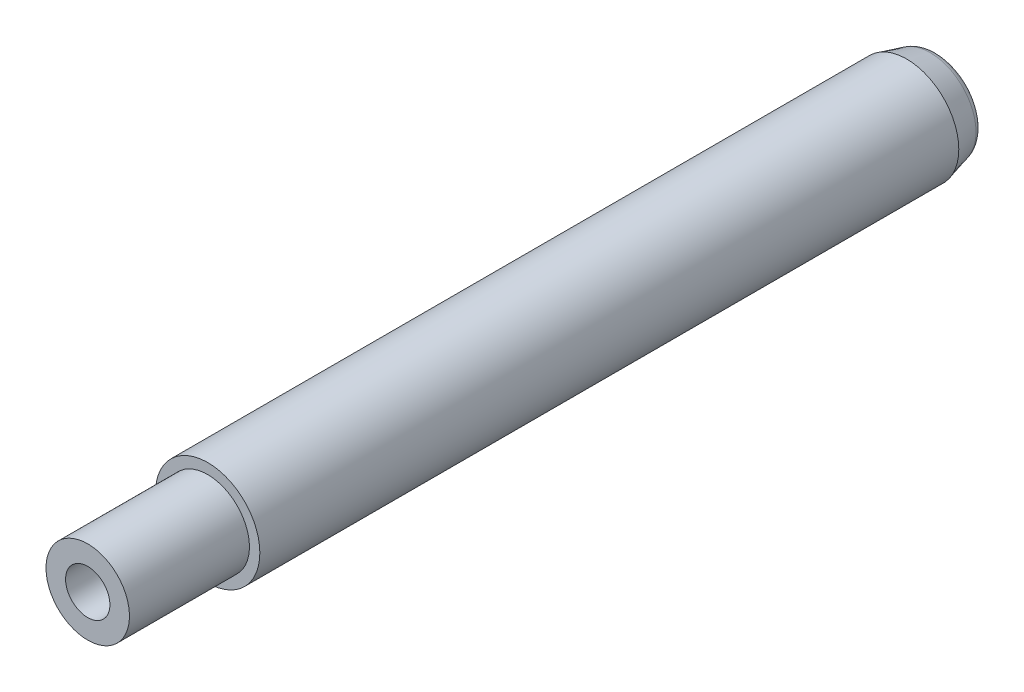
ISO-10303-21;
HEADER;
FILE_DESCRIPTION(('STEP AP214'),'2;1');
FILE_NAME('part.step','',(''),(''),'','','');
FILE_SCHEMA(('AUTOMOTIVE_DESIGN { 1 0 10303 214 1 1 1 1 }'));
ENDSEC;
DATA;
#1=APPLICATION_CONTEXT('core data for automotive mechanical design processes');
#2=APPLICATION_PROTOCOL_DEFINITION('international standard','automotive_design',2000,#1);
#3=PRODUCT_CONTEXT('',#1,'mechanical');
#4=PRODUCT('Part','Part','',(#3));
#5=PRODUCT_RELATED_PRODUCT_CATEGORY('part','',(#4));
#6=PRODUCT_DEFINITION_FORMATION('','',#4);
#7=PRODUCT_DEFINITION_CONTEXT('part definition',#1,'design');
#8=PRODUCT_DEFINITION('design','',#6,#7);
#9=PRODUCT_DEFINITION_SHAPE('','',#8);
#10=(LENGTH_UNIT() NAMED_UNIT(*) SI_UNIT(.MILLI.,.METRE.));
#11=(NAMED_UNIT(*) PLANE_ANGLE_UNIT() SI_UNIT($,.RADIAN.));
#12=(NAMED_UNIT(*) SI_UNIT($,.STERADIAN.) SOLID_ANGLE_UNIT());
#13=UNCERTAINTY_MEASURE_WITH_UNIT(LENGTH_MEASURE(1.E-05),#10,'distance_accuracy_value','');
#14=(GEOMETRIC_REPRESENTATION_CONTEXT(3) GLOBAL_UNCERTAINTY_ASSIGNED_CONTEXT((#13)) GLOBAL_UNIT_ASSIGNED_CONTEXT((#10,
#11,#12)) REPRESENTATION_CONTEXT('',''));
#15=CARTESIAN_POINT('',(0.,0.,0.));
#16=DIRECTION('',(0.,0.,1.));
#17=DIRECTION('',(1.,0.,0.));
#18=AXIS2_PLACEMENT_3D('',#15,#16,#17);
#19=CARTESIAN_POINT('',(0.,0.,22.9999999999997));
#20=DIRECTION('',(0.,0.,-0.999999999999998));
#21=DIRECTION('',(-1.00000000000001,0.,0.));
#22=AXIS2_PLACEMENT_3D('',#19,#20,#21);
#23=CYLINDRICAL_SURFACE('',#22,8.);
#24=CARTESIAN_POINT('',(0.,0.,22.9999999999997));
#25=DIRECTION('',(0.,0.,0.999999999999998));
#26=DIRECTION('',(1.00000000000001,0.,0.));
#27=AXIS2_PLACEMENT_3D('',#24,#25,#26);
#28=CIRCLE('',#27,8.);
#29=CARTESIAN_POINT('',(-8.00000000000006,0.,22.9999999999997));
#30=VERTEX_POINT('',#29);
#31=EDGE_CURVE('E61',#30,#30,#28,.T.);
#32=CARTESIAN_POINT('',(0.,0.,-2.22044604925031E-13));
#33=DIRECTION('',(0.,0.,-0.999999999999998));
#34=DIRECTION('',(-1.00000000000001,0.,0.));
#35=AXIS2_PLACEMENT_3D('',#32,#33,#34);
#36=CIRCLE('',#35,8.);
#37=CARTESIAN_POINT('',(-8.00000000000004,0.,-2.25514051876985E-13));
#38=VERTEX_POINT('',#37);
#39=EDGE_CURVE('E58',#38,#38,#36,.T.);
#40=CARTESIAN_POINT('',(-8.00000000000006,0.,22.9999999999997));
#41=CARTESIAN_POINT('',(-8.00000000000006,0.,22.7604166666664));
#42=CARTESIAN_POINT('',(-8.00000000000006,0.,22.5208333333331));
#43=CARTESIAN_POINT('',(-8.00000000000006,0.,22.0416666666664));
#44=CARTESIAN_POINT('',(-8.00000000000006,0.,21.8020833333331));
#45=CARTESIAN_POINT('',(-8.00000000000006,0.,21.3229166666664));
#46=CARTESIAN_POINT('',(-8.00000000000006,0.,21.0833333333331));
#47=CARTESIAN_POINT('',(-8.00000000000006,0.,20.6041666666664));
#48=CARTESIAN_POINT('',(-8.00000000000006,0.,20.3645833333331));
#49=CARTESIAN_POINT('',(-8.00000000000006,0.,19.8854166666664));
#50=CARTESIAN_POINT('',(-8.00000000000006,0.,19.6458333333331));
#51=CARTESIAN_POINT('',(-8.00000000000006,0.,19.1666666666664));
#52=CARTESIAN_POINT('',(-8.00000000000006,0.,18.9270833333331));
#53=CARTESIAN_POINT('',(-8.00000000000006,0.,18.4479166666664));
#54=CARTESIAN_POINT('',(-8.00000000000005,0.,18.2083333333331));
#55=CARTESIAN_POINT('',(-8.00000000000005,0.,17.7291666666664));
#56=CARTESIAN_POINT('',(-8.00000000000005,0.,17.4895833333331));
#57=CARTESIAN_POINT('',(-8.00000000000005,0.,17.0104166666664));
#58=CARTESIAN_POINT('',(-8.00000000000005,0.,16.7708333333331));
#59=CARTESIAN_POINT('',(-8.00000000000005,0.,16.2916666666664));
#60=CARTESIAN_POINT('',(-8.00000000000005,0.,16.0520833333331));
#61=CARTESIAN_POINT('',(-8.00000000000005,0.,15.5729166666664));
#62=CARTESIAN_POINT('',(-8.00000000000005,0.,15.3333333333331));
#63=CARTESIAN_POINT('',(-8.00000000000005,0.,14.8541666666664));
#64=CARTESIAN_POINT('',(-8.00000000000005,0.,14.6145833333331));
#65=CARTESIAN_POINT('',(-8.00000000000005,0.,14.1354166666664));
#66=CARTESIAN_POINT('',(-8.00000000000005,0.,13.8958333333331));
#67=CARTESIAN_POINT('',(-8.00000000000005,0.,13.4166666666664));
#68=CARTESIAN_POINT('',(-8.00000000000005,0.,13.1770833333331));
#69=CARTESIAN_POINT('',(-8.00000000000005,0.,12.6979166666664));
#70=CARTESIAN_POINT('',(-8.00000000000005,0.,12.4583333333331));
#71=CARTESIAN_POINT('',(-8.00000000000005,0.,11.9791666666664));
#72=CARTESIAN_POINT('',(-8.00000000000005,0.,11.7395833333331));
#73=CARTESIAN_POINT('',(-8.00000000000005,0.,11.2604166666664));
#74=CARTESIAN_POINT('',(-8.00000000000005,0.,11.0208333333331));
#75=CARTESIAN_POINT('',(-8.00000000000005,0.,10.5416666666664));
#76=CARTESIAN_POINT('',(-8.00000000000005,0.,10.3020833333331));
#77=CARTESIAN_POINT('',(-8.00000000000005,0.,9.82291666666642));
#78=CARTESIAN_POINT('',(-8.00000000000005,0.,9.58333333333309));
#79=CARTESIAN_POINT('',(-8.00000000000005,0.,9.10416666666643));
#80=CARTESIAN_POINT('',(-8.00000000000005,0.,8.86458333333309));
#81=CARTESIAN_POINT('',(-8.00000000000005,0.,8.38541666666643));
#82=CARTESIAN_POINT('',(-8.00000000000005,0.,8.14583333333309));
#83=CARTESIAN_POINT('',(-8.00000000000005,0.,7.66666666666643));
#84=CARTESIAN_POINT('',(-8.00000000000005,0.,7.4270833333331));
#85=CARTESIAN_POINT('',(-8.00000000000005,0.,6.94791666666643));
#86=CARTESIAN_POINT('',(-8.00000000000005,0.,6.7083333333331));
#87=CARTESIAN_POINT('',(-8.00000000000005,0.,6.22916666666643));
#88=CARTESIAN_POINT('',(-8.00000000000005,0.,5.9895833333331));
#89=CARTESIAN_POINT('',(-8.00000000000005,0.,5.51041666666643));
#90=CARTESIAN_POINT('',(-8.00000000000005,0.,5.2708333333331));
#91=CARTESIAN_POINT('',(-8.00000000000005,0.,4.79166666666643));
#92=CARTESIAN_POINT('',(-8.00000000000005,0.,4.5520833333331));
#93=CARTESIAN_POINT('',(-8.00000000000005,0.,4.07291666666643));
#94=CARTESIAN_POINT('',(-8.00000000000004,0.,3.8333333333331));
#95=CARTESIAN_POINT('',(-8.00000000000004,0.,3.35416666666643));
#96=CARTESIAN_POINT('',(-8.00000000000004,0.,3.1145833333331));
#97=CARTESIAN_POINT('',(-8.00000000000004,0.,2.63541666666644));
#98=CARTESIAN_POINT('',(-8.00000000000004,0.,2.39583333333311));
#99=CARTESIAN_POINT('',(-8.00000000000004,0.,1.91666666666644));
#100=CARTESIAN_POINT('',(-8.00000000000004,0.,1.67708333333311));
#101=CARTESIAN_POINT('',(-8.00000000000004,0.,1.19791666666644));
#102=CARTESIAN_POINT('',(-8.00000000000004,0.,0.958333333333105));
#103=CARTESIAN_POINT('',(-8.00000000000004,0.,0.479166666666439));
#104=CARTESIAN_POINT('',(-8.00000000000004,0.,0.239583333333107));
#105=CARTESIAN_POINT('',(-8.00000000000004,0.,-2.25514051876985E-13));
#106=B_SPLINE_CURVE_WITH_KNOTS('',3,(#40,#41,#42,#43,#44,#45,#46,#47,#48,#49,#50,#51,#52,#53,
#54,#55,#56,#57,#58,#59,#60,#61,#62,#63,#64,#65,#66,#67,#68,#69,#70,#71,#72,#73,#74,#75,#76,#77,
#78,#79,#80,#81,#82,#83,#84,#85,#86,#87,#88,#89,#90,#91,#92,#93,#94,#95,#96,#97,#98,#99,#100,
#101,#102,#103,#104,#105),.UNSPECIFIED.,.F.,.F.,(4,2,2,2,2,2,2,2,2,2,2,2,2,2,2,2,2,2,2,2,2,2,2,
2,2,2,2,2,2,2,2,2,4),(0.,0.718750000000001,1.4375,2.15625,2.875,3.59375,4.31249999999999,
5.03124999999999,5.74999999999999,6.46874999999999,7.18749999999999,7.90624999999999,
8.62499999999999,9.34374999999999,10.0625,10.78125,11.5,12.21875,12.9375,13.65625,14.375,
15.09375,15.8125,16.53125,17.25,17.96875,18.6875,19.40625,20.125,20.84375,21.5625,22.28125,23.),.UNSPECIFIED.);
#107=EDGE_CURVE('BSEAM31',#30,#38,#106,.T.);
#108=ORIENTED_EDGE('',*,*,#31,.F.);
#109=ORIENTED_EDGE('',*,*,#39,.F.);
#110=ORIENTED_EDGE('',*,*,#107,.T.);
#111=ORIENTED_EDGE('',*,*,#107,.F.);
#112=EDGE_LOOP('',(#108,#110,#109,#111));
#113=FACE_BOUND('',#112,.T.);
#114=ADVANCED_FACE('F31',(#113),#23,.T.);
#115=CARTESIAN_POINT('',(0.,0.,22.9999999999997));
#116=DIRECTION('',(0.,0.,0.999999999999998));
#117=DIRECTION('',(1.00000000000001,0.,0.));
#118=AXIS2_PLACEMENT_3D('',#115,#116,#117);
#119=PLANE('',#118);
#120=CARTESIAN_POINT('',(0.,0.,22.9999999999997));
#121=DIRECTION('',(0.,0.,0.999999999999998));
#122=DIRECTION('',(1.00000000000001,0.,0.));
#123=AXIS2_PLACEMENT_3D('',#120,#121,#122);
#124=CIRCLE('',#123,4.25);
#125=CARTESIAN_POINT('',(4.25000000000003,0.,22.9999999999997));
#126=VERTEX_POINT('',#125);
#127=EDGE_CURVE('E50',#126,#126,#124,.T.);
#128=ORIENTED_EDGE('',*,*,#127,.F.);
#129=EDGE_LOOP('',(#128));
#130=FACE_BOUND('',#129,.T.);
#131=ORIENTED_EDGE('',*,*,#31,.T.);
#132=EDGE_LOOP('',(#131));
#133=FACE_BOUND('',#132,.T.);
#134=ADVANCED_FACE('F82',(#130,#133),#119,.T.);
#135=CARTESIAN_POINT('',(0.,0.,-2.22044604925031E-13));
#136=DIRECTION('',(0.,0.,-0.999999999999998));
#137=DIRECTION('',(-1.00000000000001,0.,0.));
#138=AXIS2_PLACEMENT_3D('',#135,#136,#137);
#139=PLANE('',#138);
#140=CARTESIAN_POINT('',(0.,0.,-2.22044604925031E-13));
#141=DIRECTION('',(0.,0.,-0.999999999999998));
#142=DIRECTION('',(-1.00000000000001,0.,0.));
#143=AXIS2_PLACEMENT_3D('',#140,#141,#142);
#144=CIRCLE('',#143,10.);
#145=CARTESIAN_POINT('',(9.99999999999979,-1.3460885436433E-13,-1.94289029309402E-13));
#146=VERTEX_POINT('',#145);
#147=EDGE_CURVE('E53',#146,#146,#144,.T.);
#148=ORIENTED_EDGE('',*,*,#147,.F.);
#149=EDGE_LOOP('',(#148));
#150=FACE_BOUND('',#149,.T.);
#151=ORIENTED_EDGE('',*,*,#39,.T.);
#152=EDGE_LOOP('',(#151));
#153=FACE_BOUND('',#152,.T.);
#154=ADVANCED_FACE('F87',(#150,#153),#139,.F.);
#155=CARTESIAN_POINT('',(-2.0122792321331E-13,-1.2490009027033E-13,-140.));
#156=DIRECTION('',(0.,0.,0.999999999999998));
#157=DIRECTION('',(1.00000000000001,0.,0.));
#158=AXIS2_PLACEMENT_3D('',#155,#156,#157);
#159=CYLINDRICAL_SURFACE('',#158,10.);
#160=CARTESIAN_POINT('',(-2.0122792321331E-13,-1.11022302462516E-13,-134.));
#161=DIRECTION('',(0.,0.,-0.999999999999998));
#162=DIRECTION('',(-1.00000000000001,0.,0.));
#163=AXIS2_PLACEMENT_3D('',#160,#161,#162);
#164=CIRCLE('',#163,10.);
#165=CARTESIAN_POINT('',(9.99999999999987,-1.15221080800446E-13,-134.));
#166=VERTEX_POINT('',#165);
#167=EDGE_CURVE('E64',#166,#166,#164,.F.);
#168=CARTESIAN_POINT('',(9.99999999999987,-1.15221080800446E-13,-134.));
#169=CARTESIAN_POINT('',(9.99999999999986,-1.15423036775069E-13,-132.604166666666));
#170=CARTESIAN_POINT('',(9.99999999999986,-1.15624992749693E-13,-131.208333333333));
#171=CARTESIAN_POINT('',(9.99999999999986,-1.16028904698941E-13,-128.416666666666));
#172=CARTESIAN_POINT('',(9.99999999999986,-1.16230860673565E-13,-127.020833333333));
#173=CARTESIAN_POINT('',(9.99999999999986,-1.16634772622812E-13,-124.229166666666));
#174=CARTESIAN_POINT('',(9.99999999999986,-1.16836728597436E-13,-122.833333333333));
#175=CARTESIAN_POINT('',(9.99999999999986,-1.17240640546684E-13,-120.041666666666));
#176=CARTESIAN_POINT('',(9.99999999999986,-1.17442596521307E-13,-118.645833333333));
#177=CARTESIAN_POINT('',(9.99999999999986,-1.17846508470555E-13,-115.854166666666));
#178=CARTESIAN_POINT('',(9.99999999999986,-1.18048464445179E-13,-114.458333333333));
#179=CARTESIAN_POINT('',(9.99999999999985,-1.18452376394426E-13,-111.666666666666));
#180=CARTESIAN_POINT('',(9.99999999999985,-1.1865433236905E-13,-110.270833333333));
#181=CARTESIAN_POINT('',(9.99999999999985,-1.19058244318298E-13,-107.479166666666));
#182=CARTESIAN_POINT('',(9.99999999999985,-1.19260200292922E-13,-106.083333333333));
#183=CARTESIAN_POINT('',(9.99999999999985,-1.19664112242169E-13,-103.291666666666));
#184=CARTESIAN_POINT('',(9.99999999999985,-1.19866068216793E-13,-101.895833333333));
#185=CARTESIAN_POINT('',(9.99999999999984,-1.20269980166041E-13,-99.1041666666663));
#186=CARTESIAN_POINT('',(9.99999999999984,-1.20471936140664E-13,-97.708333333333));
#187=CARTESIAN_POINT('',(9.99999999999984,-1.20875848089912E-13,-94.9166666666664));
#188=CARTESIAN_POINT('',(9.99999999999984,-1.21077804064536E-13,-93.520833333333));
#189=CARTESIAN_POINT('',(9.99999999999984,-1.21481716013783E-13,-90.7291666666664));
#190=CARTESIAN_POINT('',(9.99999999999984,-1.21683671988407E-13,-89.3333333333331));
#191=CARTESIAN_POINT('',(9.99999999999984,-1.22087583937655E-13,-86.5416666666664));
#192=CARTESIAN_POINT('',(9.99999999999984,-1.22289539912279E-13,-85.1458333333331));
#193=CARTESIAN_POINT('',(9.99999999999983,-1.22693451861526E-13,-82.3541666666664));
#194=CARTESIAN_POINT('',(9.99999999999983,-1.2289540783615E-13,-80.9583333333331));
#195=CARTESIAN_POINT('',(9.99999999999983,-1.23299319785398E-13,-78.1666666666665));
#196=CARTESIAN_POINT('',(9.99999999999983,-1.23501275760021E-13,-76.7708333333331));
#197=CARTESIAN_POINT('',(9.99999999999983,-1.23905187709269E-13,-73.9791666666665));
#198=CARTESIAN_POINT('',(9.99999999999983,-1.24107143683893E-13,-72.5833333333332));
#199=CARTESIAN_POINT('',(9.99999999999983,-1.2451105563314E-13,-69.7916666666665));
#200=CARTESIAN_POINT('',(9.99999999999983,-1.24713011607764E-13,-68.3958333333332));
#201=CARTESIAN_POINT('',(9.99999999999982,-1.25116923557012E-13,-65.6041666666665));
#202=CARTESIAN_POINT('',(9.99999999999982,-1.25318879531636E-13,-64.2083333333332));
#203=CARTESIAN_POINT('',(9.99999999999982,-1.25722791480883E-13,-61.4166666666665));
#204=CARTESIAN_POINT('',(9.99999999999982,-1.25924747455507E-13,-60.0208333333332));
#205=CARTESIAN_POINT('',(9.99999999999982,-1.26328659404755E-13,-57.2291666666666));
#206=CARTESIAN_POINT('',(9.99999999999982,-1.26530615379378E-13,-55.8333333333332));
#207=CARTESIAN_POINT('',(9.99999999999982,-1.26934527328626E-13,-53.0416666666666));
#208=CARTESIAN_POINT('',(9.99999999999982,-1.2713648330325E-13,-51.6458333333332));
#209=CARTESIAN_POINT('',(9.99999999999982,-1.27540395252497E-13,-48.8541666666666));
#210=CARTESIAN_POINT('',(9.99999999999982,-1.27742351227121E-13,-47.4583333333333));
#211=CARTESIAN_POINT('',(9.99999999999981,-1.28146263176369E-13,-44.6666666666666));
#212=CARTESIAN_POINT('',(9.99999999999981,-1.28348219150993E-13,-43.2708333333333));
#213=CARTESIAN_POINT('',(9.99999999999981,-1.2875213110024E-13,-40.4791666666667));
#214=CARTESIAN_POINT('',(9.99999999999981,-1.28954087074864E-13,-39.0833333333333));
#215=CARTESIAN_POINT('',(9.99999999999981,-1.29357999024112E-13,-36.2916666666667));
#216=CARTESIAN_POINT('',(9.99999999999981,-1.29559954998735E-13,-34.8958333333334));
#217=CARTESIAN_POINT('',(9.99999999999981,-1.29963866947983E-13,-32.1041666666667));
#218=CARTESIAN_POINT('',(9.99999999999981,-1.30165822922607E-13,-30.7083333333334));
#219=CARTESIAN_POINT('',(9.9999999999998,-1.30569734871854E-13,-27.9166666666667));
#220=CARTESIAN_POINT('',(9.9999999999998,-1.30771690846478E-13,-26.5208333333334));
#221=CARTESIAN_POINT('',(9.9999999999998,-1.31175602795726E-13,-23.7291666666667));
#222=CARTESIAN_POINT('',(9.9999999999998,-1.31377558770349E-13,-22.3333333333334));
#223=CARTESIAN_POINT('',(9.9999999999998,-1.31781470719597E-13,-19.5416666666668));
#224=CARTESIAN_POINT('',(9.9999999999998,-1.31983426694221E-13,-18.1458333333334));
#225=CARTESIAN_POINT('',(9.99999999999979,-1.32387338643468E-13,-15.3541666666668));
#226=CARTESIAN_POINT('',(9.99999999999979,-1.32589294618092E-13,-13.9583333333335));
#227=CARTESIAN_POINT('',(9.99999999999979,-1.3299320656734E-13,-11.1666666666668));
#228=CARTESIAN_POINT('',(9.99999999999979,-1.33195162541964E-13,-9.77083333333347));
#229=CARTESIAN_POINT('',(9.99999999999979,-1.33599074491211E-13,-6.97916666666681));
#230=CARTESIAN_POINT('',(9.99999999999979,-1.33801030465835E-13,-5.5833333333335));
#231=CARTESIAN_POINT('',(9.99999999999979,-1.34204942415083E-13,-2.79166666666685));
#232=CARTESIAN_POINT('',(9.99999999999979,-1.34406898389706E-13,-1.39583333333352));
#233=CARTESIAN_POINT('',(9.99999999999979,-1.3460885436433E-13,-1.94289029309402E-13));
#234=B_SPLINE_CURVE_WITH_KNOTS('',3,(#168,#169,#170,#171,#172,#173,#174,#175,#176,#177,#178,
#179,#180,#181,#182,#183,#184,#185,#186,#187,#188,#189,#190,#191,#192,#193,#194,#195,#196,#197,
#198,#199,#200,#201,#202,#203,#204,#205,#206,#207,#208,#209,#210,#211,#212,#213,#214,#215,#216,
#217,#218,#219,#220,#221,#222,#223,#224,#225,#226,#227,#228,#229,#230,#231,#232,#233),
.UNSPECIFIED.,.F.,.F.,(4,2,2,2,2,2,2,2,2,2,2,2,2,2,2,2,2,2,2,2,2,2,2,2,2,2,2,2,2,2,2,2,4),(0.,
4.18749999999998,8.37499999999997,12.5624999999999,16.7499999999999,20.9374999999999,
25.1249999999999,29.3124999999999,33.4999999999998,37.6874999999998,41.8749999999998,
46.0624999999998,50.2499999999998,54.4374999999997,58.6249999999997,62.8124999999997,
66.9999999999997,71.1874999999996,75.3749999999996,79.5624999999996,83.7499999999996,
87.9374999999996,92.1249999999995,96.3124999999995,100.499999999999,104.687499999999,
108.874999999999,113.062499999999,117.249999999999,121.437499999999,125.624999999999,
129.812499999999,133.999999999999),.UNSPECIFIED.);
#235=EDGE_CURVE('BSEAM94',#166,#146,#234,.T.);
#236=ORIENTED_EDGE('',*,*,#167,.T.);
#237=ORIENTED_EDGE('',*,*,#147,.T.);
#238=ORIENTED_EDGE('',*,*,#235,.T.);
#239=ORIENTED_EDGE('',*,*,#235,.F.);
#240=EDGE_LOOP('',(#236,#238,#237,#239));
#241=FACE_BOUND('',#240,.T.);
#242=ADVANCED_FACE('F94',(#241),#159,.T.);
#243=CARTESIAN_POINT('',(-2.0122792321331E-13,-1.2490009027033E-13,-140.));
#244=DIRECTION('',(0.,0.,-0.999999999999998));
#245=DIRECTION('',(-1.00000000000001,0.,0.));
#246=AXIS2_PLACEMENT_3D('',#243,#244,#245);
#247=PLANE('',#246);
#248=CARTESIAN_POINT('',(-2.0122792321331E-13,-1.2490009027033E-13,-140.));
#249=DIRECTION('',(0.,0.,-0.999999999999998));
#250=DIRECTION('',(-1.00000000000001,0.,0.));
#251=AXIS2_PLACEMENT_3D('',#248,#249,#250);
#252=CIRCLE('',#251,6.85765086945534);
#253=CARTESIAN_POINT('',(-6.85765086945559,-1.32132936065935E-13,-140.));
#254=VERTEX_POINT('',#253);
#255=EDGE_CURVE('E37',#254,#254,#252,.T.);
#256=ORIENTED_EDGE('',*,*,#255,.T.);
#257=EDGE_LOOP('',(#256));
#258=FACE_BOUND('',#257,.T.);
#259=ADVANCED_FACE('F69',(#258),#247,.T.);
#260=CARTESIAN_POINT('',(0.,0.,22.9999999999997));
#261=DIRECTION('',(0.,0.,0.999999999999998));
#262=DIRECTION('',(1.00000000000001,0.,0.));
#263=AXIS2_PLACEMENT_3D('',#260,#261,#262);
#264=CYLINDRICAL_SURFACE('',#263,4.25);
#265=CARTESIAN_POINT('',(0.,0.,-4.00000000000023));
#266=DIRECTION('',(0.,0.,0.999999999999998));
#267=DIRECTION('',(1.00000000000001,0.,0.));
#268=AXIS2_PLACEMENT_3D('',#265,#266,#267);
#269=CIRCLE('',#268,4.24999999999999);
#270=CARTESIAN_POINT('',(4.25000000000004,0.,-4.00000000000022));
#271=VERTEX_POINT('',#270);
#272=EDGE_CURVE('E48',#271,#271,#269,.T.);
#273=CARTESIAN_POINT('',(4.25000000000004,0.,-4.00000000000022));
#274=CARTESIAN_POINT('',(4.25000000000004,0.,-3.71875000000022));
#275=CARTESIAN_POINT('',(4.25000000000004,0.,-3.43750000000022));
#276=CARTESIAN_POINT('',(4.25000000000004,0.,-2.87500000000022));
#277=CARTESIAN_POINT('',(4.25000000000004,0.,-2.59375000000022));
#278=CARTESIAN_POINT('',(4.25000000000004,0.,-2.03125000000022));
#279=CARTESIAN_POINT('',(4.25000000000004,0.,-1.75000000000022));
#280=CARTESIAN_POINT('',(4.25000000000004,0.,-1.18750000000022));
#281=CARTESIAN_POINT('',(4.25000000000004,0.,-0.906250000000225));
#282=CARTESIAN_POINT('',(4.25000000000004,0.,-0.343750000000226));
#283=CARTESIAN_POINT('',(4.25000000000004,0.,-0.0625000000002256));
#284=CARTESIAN_POINT('',(4.25000000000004,0.,0.499999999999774));
#285=CARTESIAN_POINT('',(4.25000000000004,0.,0.781249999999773));
#286=CARTESIAN_POINT('',(4.25000000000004,0.,1.34374999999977));
#287=CARTESIAN_POINT('',(4.25000000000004,0.,1.62499999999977));
#288=CARTESIAN_POINT('',(4.25000000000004,0.,2.18749999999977));
#289=CARTESIAN_POINT('',(4.25000000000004,0.,2.46874999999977));
#290=CARTESIAN_POINT('',(4.25000000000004,0.,3.03124999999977));
#291=CARTESIAN_POINT('',(4.25000000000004,0.,3.31249999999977));
#292=CARTESIAN_POINT('',(4.25000000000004,0.,3.87499999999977));
#293=CARTESIAN_POINT('',(4.25000000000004,0.,4.15624999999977));
#294=CARTESIAN_POINT('',(4.25000000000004,0.,4.71874999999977));
#295=CARTESIAN_POINT('',(4.25000000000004,0.,4.99999999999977));
#296=CARTESIAN_POINT('',(4.25000000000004,0.,5.56249999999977));
#297=CARTESIAN_POINT('',(4.25000000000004,0.,5.84374999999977));
#298=CARTESIAN_POINT('',(4.25000000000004,0.,6.40624999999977));
#299=CARTESIAN_POINT('',(4.25000000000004,0.,6.68749999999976));
#300=CARTESIAN_POINT('',(4.25000000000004,0.,7.24999999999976));
#301=CARTESIAN_POINT('',(4.25000000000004,0.,7.53124999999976));
#302=CARTESIAN_POINT('',(4.25000000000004,0.,8.09374999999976));
#303=CARTESIAN_POINT('',(4.25000000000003,0.,8.37499999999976));
#304=CARTESIAN_POINT('',(4.25000000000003,0.,8.93749999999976));
#305=CARTESIAN_POINT('',(4.25000000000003,0.,9.21874999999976));
#306=CARTESIAN_POINT('',(4.25000000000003,0.,9.78124999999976));
#307=CARTESIAN_POINT('',(4.25000000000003,0.,10.0624999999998));
#308=CARTESIAN_POINT('',(4.25000000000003,0.,10.6249999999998));
#309=CARTESIAN_POINT('',(4.25000000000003,0.,10.9062499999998));
#310=CARTESIAN_POINT('',(4.25000000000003,0.,11.4687499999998));
#311=CARTESIAN_POINT('',(4.25000000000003,0.,11.7499999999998));
#312=CARTESIAN_POINT('',(4.25000000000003,0.,12.3124999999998));
#313=CARTESIAN_POINT('',(4.25000000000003,0.,12.5937499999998));
#314=CARTESIAN_POINT('',(4.25000000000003,0.,13.1562499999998));
#315=CARTESIAN_POINT('',(4.25000000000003,0.,13.4374999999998));
#316=CARTESIAN_POINT('',(4.25000000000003,0.,13.9999999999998));
#317=CARTESIAN_POINT('',(4.25000000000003,0.,14.2812499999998));
#318=CARTESIAN_POINT('',(4.25000000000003,0.,14.8437499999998));
#319=CARTESIAN_POINT('',(4.25000000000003,0.,15.1249999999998));
#320=CARTESIAN_POINT('',(4.25000000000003,0.,15.6874999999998));
#321=CARTESIAN_POINT('',(4.25000000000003,0.,15.9687499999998));
#322=CARTESIAN_POINT('',(4.25000000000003,0.,16.5312499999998));
#323=CARTESIAN_POINT('',(4.25000000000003,0.,16.8124999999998));
#324=CARTESIAN_POINT('',(4.25000000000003,0.,17.3749999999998));
#325=CARTESIAN_POINT('',(4.25000000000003,0.,17.6562499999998));
#326=CARTESIAN_POINT('',(4.25000000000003,0.,18.2187499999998));
#327=CARTESIAN_POINT('',(4.25000000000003,0.,18.4999999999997));
#328=CARTESIAN_POINT('',(4.25000000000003,0.,19.0624999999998));
#329=CARTESIAN_POINT('',(4.25000000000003,0.,19.3437499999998));
#330=CARTESIAN_POINT('',(4.25000000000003,0.,19.9062499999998));
#331=CARTESIAN_POINT('',(4.25000000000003,0.,20.1874999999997));
#332=CARTESIAN_POINT('',(4.25000000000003,0.,20.7499999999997));
#333=CARTESIAN_POINT('',(4.25000000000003,0.,21.0312499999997));
#334=CARTESIAN_POINT('',(4.25000000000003,0.,21.5937499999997));
#335=CARTESIAN_POINT('',(4.25000000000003,0.,21.8749999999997));
#336=CARTESIAN_POINT('',(4.25000000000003,0.,22.4374999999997));
#337=CARTESIAN_POINT('',(4.25000000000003,0.,22.7187499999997));
#338=CARTESIAN_POINT('',(4.25000000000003,0.,22.9999999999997));
#339=B_SPLINE_CURVE_WITH_KNOTS('',3,(#273,#274,#275,#276,#277,#278,#279,#280,#281,#282,#283,
#284,#285,#286,#287,#288,#289,#290,#291,#292,#293,#294,#295,#296,#297,#298,#299,#300,#301,#302,
#303,#304,#305,#306,#307,#308,#309,#310,#311,#312,#313,#314,#315,#316,#317,#318,#319,#320,#321,
#322,#323,#324,#325,#326,#327,#328,#329,#330,#331,#332,#333,#334,#335,#336,#337,#338),
.UNSPECIFIED.,.F.,.F.,(4,2,2,2,2,2,2,2,2,2,2,2,2,2,2,2,2,2,2,2,2,2,2,2,2,2,2,2,2,2,2,2,4),(0.,
0.843749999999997,1.6875,2.53125,3.375,4.21875,5.06249999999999,5.90624999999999,
6.74999999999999,7.59374999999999,8.43749999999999,9.28124999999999,10.125,10.96875,11.8125,
12.65625,13.5,14.34375,15.1875,16.03125,16.875,17.71875,18.5625,19.40625,20.25,21.09375,21.9375,
22.78125,23.625,24.46875,25.3125,26.15625,27.),.UNSPECIFIED.);
#340=EDGE_CURVE('BSEAM44',#271,#126,#339,.T.);
#341=ORIENTED_EDGE('',*,*,#272,.F.);
#342=ORIENTED_EDGE('',*,*,#127,.T.);
#343=ORIENTED_EDGE('',*,*,#340,.T.);
#344=ORIENTED_EDGE('',*,*,#340,.F.);
#345=EDGE_LOOP('',(#341,#343,#342,#344));
#346=FACE_BOUND('',#345,.T.);
#347=ADVANCED_FACE('F44',(#346),#264,.F.);
#348=CARTESIAN_POINT('',(0.,0.,-4.00000000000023));
#349=DIRECTION('',(0.,0.,0.999999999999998));
#350=DIRECTION('',(1.00000000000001,0.,0.));
#351=AXIS2_PLACEMENT_3D('',#348,#349,#350);
#352=CONICAL_SURFACE('',#351,4.24999999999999,1.02974425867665);
#353=CARTESIAN_POINT('',(0.,0.,-6.55365763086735));
#354=VERTEX_POINT('',#353);
#355=VERTEX_LOOP('',#354);
#356=FACE_BOUND('',#355,.T.);
#357=ORIENTED_EDGE('',*,*,#272,.T.);
#358=EDGE_LOOP('',(#357));
#359=FACE_BOUND('',#358,.T.);
#360=ADVANCED_FACE('F40',(#356,#359),#352,.F.);
#361=CARTESIAN_POINT('',(-2.0122792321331E-13,-1.2490009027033E-13,-140.));
#362=DIRECTION('',(0.,0.,0.999999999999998));
#363=DIRECTION('',(1.00000000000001,0.,0.));
#364=AXIS2_PLACEMENT_3D('',#361,#362,#363);
#365=CONICAL_SURFACE('',#364,8.39230484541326,0.261799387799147);
#366=CARTESIAN_POINT('',(-2.0122792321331E-13,-1.11022302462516E-13,-138.517638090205));
#367=DIRECTION('',(0.,0.,-0.999999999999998));
#368=DIRECTION('',(-1.00000000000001,0.,0.));
#369=AXIS2_PLACEMENT_3D('',#366,#367,#368);
#370=CIRCLE('',#369,8.78950252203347);
#371=CARTESIAN_POINT('',(8.78950252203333,-1.15844172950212E-13,-138.517638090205));
#372=VERTEX_POINT('',#371);
#373=EDGE_CURVE('E11',#372,#372,#370,.F.);
#374=CARTESIAN_POINT('',(8.78950252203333,-1.15844172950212E-13,-138.517638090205));
#375=CARTESIAN_POINT('',(8.80211187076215,-1.15837682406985E-13,-138.470579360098));
#376=CARTESIAN_POINT('',(8.81472121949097,-1.15831191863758E-13,-138.423520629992));
#377=CARTESIAN_POINT('',(8.8399399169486,-1.15818210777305E-13,-138.329403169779));
#378=CARTESIAN_POINT('',(8.85254926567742,-1.15811720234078E-13,-138.282344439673));
#379=CARTESIAN_POINT('',(8.87776796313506,-1.15798739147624E-13,-138.18822697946));
#380=CARTESIAN_POINT('',(8.89037731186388,-1.15792248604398E-13,-138.141168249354));
#381=CARTESIAN_POINT('',(8.91559600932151,-1.15779267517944E-13,-138.047050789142));
#382=CARTESIAN_POINT('',(8.92820535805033,-1.15772776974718E-13,-137.999992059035));
#383=CARTESIAN_POINT('',(8.95342405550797,-1.15759795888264E-13,-137.905874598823));
#384=CARTESIAN_POINT('',(8.96603340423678,-1.15753305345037E-13,-137.858815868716));
#385=CARTESIAN_POINT('',(8.99125210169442,-1.15740324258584E-13,-137.764698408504));
#386=CARTESIAN_POINT('',(9.00386145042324,-1.15733833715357E-13,-137.717639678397));
#387=CARTESIAN_POINT('',(9.02908014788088,-1.15720852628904E-13,-137.623522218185));
#388=CARTESIAN_POINT('',(9.04168949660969,-1.15714362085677E-13,-137.576463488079));
#389=CARTESIAN_POINT('',(9.06690819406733,-1.15701380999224E-13,-137.482346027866));
#390=CARTESIAN_POINT('',(9.07951754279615,-1.15694890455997E-13,-137.43528729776));
#391=CARTESIAN_POINT('',(9.10473624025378,-1.15681909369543E-13,-137.341169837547));
#392=CARTESIAN_POINT('',(9.1173455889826,-1.15675418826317E-13,-137.294111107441));
#393=CARTESIAN_POINT('',(9.14256428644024,-1.15662437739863E-13,-137.199993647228));
#394=CARTESIAN_POINT('',(9.15517363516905,-1.15655947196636E-13,-137.152934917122));
#395=CARTESIAN_POINT('',(9.18039233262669,-1.15642966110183E-13,-137.058817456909));
#396=CARTESIAN_POINT('',(9.19300168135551,-1.15636475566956E-13,-137.011758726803));
#397=CARTESIAN_POINT('',(9.21822037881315,-1.15623494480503E-13,-136.91764126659));
#398=CARTESIAN_POINT('',(9.23082972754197,-1.15617003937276E-13,-136.870582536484));
#399=CARTESIAN_POINT('',(9.2560484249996,-1.15604022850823E-13,-136.776465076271));
#400=CARTESIAN_POINT('',(9.26865777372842,-1.15597532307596E-13,-136.729406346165));
#401=CARTESIAN_POINT('',(9.29387647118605,-1.15584551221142E-13,-136.635288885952));
#402=CARTESIAN_POINT('',(9.30648581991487,-1.15578060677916E-13,-136.588230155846));
#403=CARTESIAN_POINT('',(9.33170451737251,-1.15565079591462E-13,-136.494112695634));
#404=CARTESIAN_POINT('',(9.34431386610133,-1.15558589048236E-13,-136.447053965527));
#405=CARTESIAN_POINT('',(9.36953256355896,-1.15545607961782E-13,-136.352936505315));
#406=CARTESIAN_POINT('',(9.38214191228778,-1.15539117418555E-13,-136.305877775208));
#407=CARTESIAN_POINT('',(9.40736060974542,-1.15526136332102E-13,-136.211760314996));
#408=CARTESIAN_POINT('',(9.41996995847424,-1.15519645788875E-13,-136.164701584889));
#409=CARTESIAN_POINT('',(9.44518865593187,-1.15506664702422E-13,-136.070584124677));
#410=CARTESIAN_POINT('',(9.45779800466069,-1.15500174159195E-13,-136.023525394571));
#411=CARTESIAN_POINT('',(9.48301670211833,-1.15487193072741E-13,-135.929407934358));
#412=CARTESIAN_POINT('',(9.49562605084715,-1.15480702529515E-13,-135.882349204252));
#413=CARTESIAN_POINT('',(9.52084474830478,-1.15467721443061E-13,-135.788231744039));
#414=CARTESIAN_POINT('',(9.5334540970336,-1.15461230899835E-13,-135.741173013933));
#415=CARTESIAN_POINT('',(9.55867279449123,-1.15448249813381E-13,-135.64705555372));
#416=CARTESIAN_POINT('',(9.57128214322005,-1.15441759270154E-13,-135.599996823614));
#417=CARTESIAN_POINT('',(9.59650084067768,-1.15428778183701E-13,-135.505879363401));
#418=CARTESIAN_POINT('',(9.6091101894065,-1.15422287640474E-13,-135.458820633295));
#419=CARTESIAN_POINT('',(9.63432888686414,-1.15409306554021E-13,-135.364703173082));
#420=CARTESIAN_POINT('',(9.64693823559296,-1.15402816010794E-13,-135.317644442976));
#421=CARTESIAN_POINT('',(9.67215693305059,-1.15389834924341E-13,-135.223526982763));
#422=CARTESIAN_POINT('',(9.68476628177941,-1.15383344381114E-13,-135.176468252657));
#423=CARTESIAN_POINT('',(9.70998497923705,-1.1537036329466E-13,-135.082350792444));
#424=CARTESIAN_POINT('',(9.72259432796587,-1.15363872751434E-13,-135.035292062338));
#425=CARTESIAN_POINT('',(9.7478130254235,-1.1535089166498E-13,-134.941174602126));
#426=CARTESIAN_POINT('',(9.76042237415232,-1.15344401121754E-13,-134.894115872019));
#427=CARTESIAN_POINT('',(9.78564107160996,-1.153314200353E-13,-134.799998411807));
#428=CARTESIAN_POINT('',(9.79825042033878,-1.15324929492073E-13,-134.7529396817));
#429=CARTESIAN_POINT('',(9.82346911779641,-1.1531194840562E-13,-134.658822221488));
#430=CARTESIAN_POINT('',(9.83607846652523,-1.15305457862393E-13,-134.611763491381));
#431=CARTESIAN_POINT('',(9.86129716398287,-1.1529247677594E-13,-134.517646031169));
#432=CARTESIAN_POINT('',(9.87390651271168,-1.15285986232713E-13,-134.470587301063));
#433=CARTESIAN_POINT('',(9.89912521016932,-1.15273005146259E-13,-134.37646984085));
#434=CARTESIAN_POINT('',(9.91173455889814,-1.15266514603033E-13,-134.329411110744));
#435=CARTESIAN_POINT('',(9.93695325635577,-1.15253533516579E-13,-134.235293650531));
#436=CARTESIAN_POINT('',(9.94956260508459,-1.15247042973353E-13,-134.188234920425));
#437=CARTESIAN_POINT('',(9.97478130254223,-1.15234061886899E-13,-134.094117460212));
#438=CARTESIAN_POINT('',(9.98739065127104,-1.15227571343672E-13,-134.047058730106));
#439=CARTESIAN_POINT('',(9.99999999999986,-1.15221080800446E-13,-134.));
#440=B_SPLINE_CURVE_WITH_KNOTS('',3,(#374,#375,#376,#377,#378,#379,#380,#381,#382,#383,#384,
#385,#386,#387,#388,#389,#390,#391,#392,#393,#394,#395,#396,#397,#398,#399,#400,#401,#402,#403,
#404,#405,#406,#407,#408,#409,#410,#411,#412,#413,#414,#415,#416,#417,#418,#419,#420,#421,#422,
#423,#424,#425,#426,#427,#428,#429,#430,#431,#432,#433,#434,#435,#436,#437,#438,#439),
.UNSPECIFIED.,.F.,.F.,(4,2,2,2,2,2,2,2,2,2,2,2,2,2,2,2,2,2,2,2,2,2,2,2,2,2,2,2,2,2,2,2,4),(0.,
0.146156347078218,0.292312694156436,0.438469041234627,0.584625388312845,0.730781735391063,
0.876938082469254,1.02309442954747,1.16925077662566,1.31540712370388,1.4615634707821,
1.60771981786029,1.75387616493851,1.90003251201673,2.04618885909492,2.19234520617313,
2.33850155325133,2.48465790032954,2.63081424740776,2.77697059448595,2.92312694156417,
3.06928328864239,3.21543963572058,3.3615959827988,3.50775232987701,3.65390867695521,
3.80006502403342,3.94622137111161,4.09237771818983,4.23853406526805,4.38469041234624,
4.53084675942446,4.67700310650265),.UNSPECIFIED.);
#441=EDGE_CURVE('BSEAM43',#372,#166,#440,.T.);
#442=ORIENTED_EDGE('',*,*,#373,.T.);
#443=ORIENTED_EDGE('',*,*,#167,.F.);
#444=ORIENTED_EDGE('',*,*,#441,.T.);
#445=ORIENTED_EDGE('',*,*,#441,.F.);
#446=EDGE_LOOP('',(#442,#444,#443,#445));
#447=FACE_BOUND('',#446,.T.);
#448=ADVANCED_FACE('F43',(#447),#365,.T.);
#449=CARTESIAN_POINT('',(-2.0122792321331E-13,-1.11022302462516E-13,-138.));
#450=DIRECTION('',(0.,0.,-0.999999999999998));
#451=DIRECTION('',(-1.00000000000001,0.,0.));
#452=AXIS2_PLACEMENT_3D('',#449,#450,#451);
#453=TOROIDAL_SURFACE('',#452,6.85765086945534,2.);
#454=ORIENTED_EDGE('',*,*,#373,.F.);
#455=EDGE_LOOP('',(#454));
#456=FACE_BOUND('',#455,.T.);
#457=ORIENTED_EDGE('',*,*,#255,.F.);
#458=EDGE_LOOP('',(#457));
#459=FACE_BOUND('',#458,.T.);
#460=ADVANCED_FACE('F71',(#456,#459),#453,.T.);
#461=CLOSED_SHELL('',(#114,#134,#154,#242,#259,#347,#360,#448,#460));
#462=MANIFOLD_SOLID_BREP('B2',#461);
#463=ADVANCED_BREP_SHAPE_REPRESENTATION('',(#18,#462),#14);
#464=SHAPE_DEFINITION_REPRESENTATION(#9,#463);
ENDSEC;
END-ISO-10303-21;
